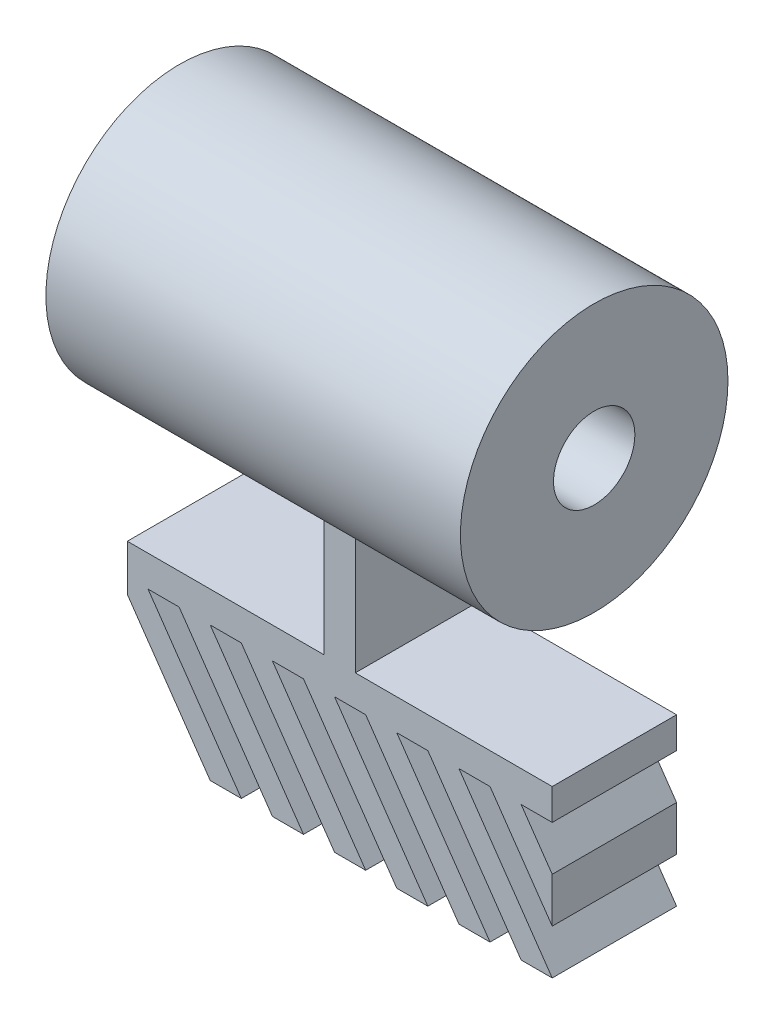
from build123d import *

# Parameters (mm, degrees)
BOSS_EXTRU_1_DEPTH      = 30
BOSS_EXTRU_1_DEPTH_BACK = 30
BOSS_EXTRU_2_DEPTH      = 100
BOSS_EXTRU_2_DEPTH_BACK = 100
ESQUISSE2_R             = 64.544753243
ESQUISSE2_R_2           = 19.627134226


with BuildPart() as part:
    # Esquisse1 → Boss.-Extru.1 (new, two sides: drawn at the far end of the back side and taken through both)
    with BuildSketch(Plane.XY.offset(-BOSS_EXTRU_1_DEPTH_BACK)):
        Polygon((-0.249284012, -200), (14.750715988, -200), (14.750715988, -270), (109.750715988, -270), (109.750715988, -285), (94.750715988, -285), (109.750715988, -306.666666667), (109.750715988, -328.333333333), (79.750715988, -285), (64.750715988, -285), (109.750715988, -350), (94.750715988, -350), (49.750715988, -285), (34.750715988, -285), (79.750715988, -350), (64.750715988, -350), (19.750715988, -285), (4.750715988, -285), (49.750715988, -350), (34.750715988, -350), (-10.249284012, -285), (-25.249284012, -285), (19.750715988, -350), (4.750715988, -350), (-40.249284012, -285), (-55.249284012, -285), (-10.249284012, -350), (-25.249284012, -350), (-70.249284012, -285), (-85.249284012, -285), (-40.249284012, -350), (-55.249284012, -350), (-95.249284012, -292.222222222), (-95.249284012, -270), (-0.249284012, -270), align=None)
    extrude(amount=BOSS_EXTRU_1_DEPTH + BOSS_EXTRU_1_DEPTH_BACK)

    # Esquisse2 → Boss.-Extru.2 (add, two sides: drawn at the far end of the back side and taken through both)
    with BuildSketch(Plane(origin=(0, 0, 0), x_dir=(0, 0, -1), z_dir=(1, 0, 0)).offset(-BOSS_EXTRU_2_DEPTH_BACK)):
        with Locations((0, -152.602639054)):
            Circle(ESQUISSE2_R)
        with Locations((0, -152.602639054)):
            Circle(ESQUISSE2_R_2, mode=Mode.SUBTRACT)
    extrude(amount=BOSS_EXTRU_2_DEPTH + BOSS_EXTRU_2_DEPTH_BACK)


solid = part.part
